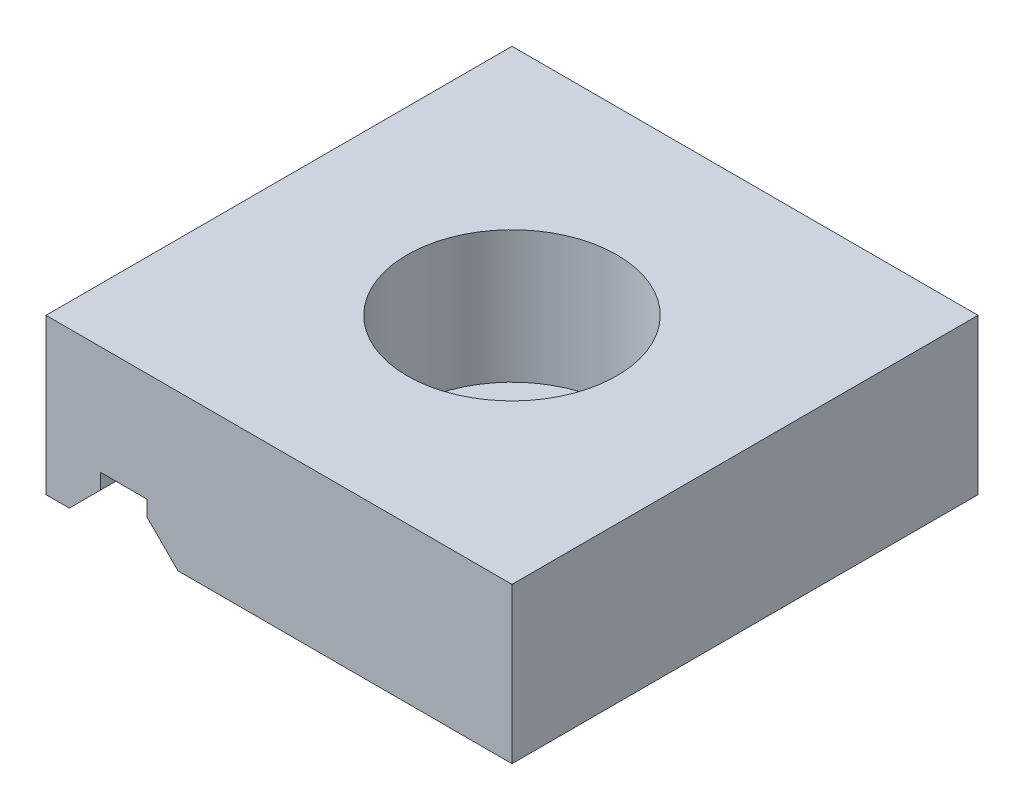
from build123d import *

# Parameters (mm, degrees)
SKIZZE1_W                                            = 30
SKIZZE1_H                                            = 30
AUFSATZ_LINEAR_AUSTRAGEN1_DEPTH                      = 10
SKIZZE2_R                                            = 7.47725
AUFSATZ_LINEAR_AUSTRAGEN2_DEPTH                      = 3
STIRNSENKUNG_F_R_M8_ZYLINDERSCHRAUBE_MIT_D           = 8.5
STIRNSENKUNG_F_R_M8_ZYLINDERSCHRAUBE_MIT_CBORE_D     = 13.5
STIRNSENKUNG_F_R_M8_ZYLINDERSCHRAUBE_MIT_CBORE_DEPTH = 8.5
SCHNITT_LINEAR_AUSTRAGEN1_DEPTH                      = 24.452078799
SCHNITT_LINEAR_AUSTRAGEN1_DEPTH_BACK                 = 24.452078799


with BuildPart() as part:
    # Skizze1 → Aufsatz-Linear austragen1 (new body)
    with BuildSketch(Plane(origin=(0, 0, 0), x_dir=(1, 0, 0), z_dir=(0, 1, 0))):
        Rectangle(SKIZZE1_W, SKIZZE1_H)
    extrude(amount=AUFSATZ_LINEAR_AUSTRAGEN1_DEPTH)

    # Skizze2 → Aufsatz-Linear austragen2 (add)
    with BuildSketch(Plane.XZ):
        with Locations(Location((0, 0, 0), (0, 0, 270))):
            Circle(SKIZZE2_R)
    extrude(amount=AUFSATZ_LINEAR_AUSTRAGEN2_DEPTH)

    # Stirnsenkung f_r M8 Zylinderschraube mit (through all)
    with Locations(Plane(origin=(0, 10, 0), x_dir=(-1, 0, 0), z_dir=(0, 1, 0))):
        with Locations((0, 0)):
            CounterBoreHole(STIRNSENKUNG_F_R_M8_ZYLINDERSCHRAUBE_MIT_D / 2, STIRNSENKUNG_F_R_M8_ZYLINDERSCHRAUBE_MIT_CBORE_D / 2, STIRNSENKUNG_F_R_M8_ZYLINDERSCHRAUBE_MIT_CBORE_DEPTH)

    # Skizze5 → Schnitt-Linear austragen1 (cut, two sides: drawn at the far end of the back side and taken through both)
    with BuildSketch(Plane.XY.offset(-SCHNITT_LINEAR_AUSTRAGEN1_DEPTH_BACK)):
        Polygon((-6.5, 0), (-5.02275, 0), (-5.02275, -3), (-13.5, -3), (-13.5, 0), (-11.5, 2), (-11.5, 3), (-8.5, 3), (-8.5, 2), align=None)
    extrude(amount=SCHNITT_LINEAR_AUSTRAGEN1_DEPTH + SCHNITT_LINEAR_AUSTRAGEN1_DEPTH_BACK, mode=Mode.SUBTRACT)


solid = part.part
